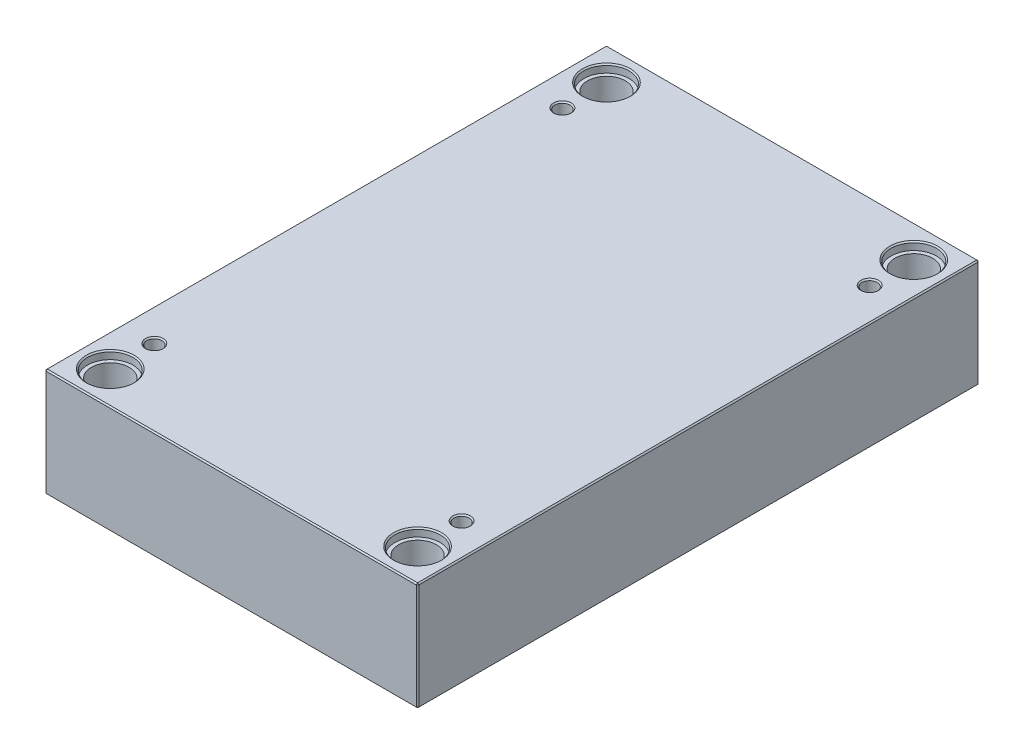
ISO-10303-21;
HEADER;
FILE_DESCRIPTION(('STEP AP214'),'2;1');
FILE_NAME('part.step','',(''),(''),'','','');
FILE_SCHEMA(('AUTOMOTIVE_DESIGN { 1 0 10303 214 1 1 1 1 }'));
ENDSEC;
DATA;
#1=APPLICATION_CONTEXT('core data for automotive mechanical design processes');
#2=APPLICATION_PROTOCOL_DEFINITION('international standard','automotive_design',2000,#1);
#3=PRODUCT_CONTEXT('',#1,'mechanical');
#4=PRODUCT('Part','Part','',(#3));
#5=PRODUCT_RELATED_PRODUCT_CATEGORY('part','',(#4));
#6=PRODUCT_DEFINITION_FORMATION('','',#4);
#7=PRODUCT_DEFINITION_CONTEXT('part definition',#1,'design');
#8=PRODUCT_DEFINITION('design','',#6,#7);
#9=PRODUCT_DEFINITION_SHAPE('','',#8);
#10=(LENGTH_UNIT() NAMED_UNIT(*) SI_UNIT(.MILLI.,.METRE.));
#11=(NAMED_UNIT(*) PLANE_ANGLE_UNIT() SI_UNIT($,.RADIAN.));
#12=(NAMED_UNIT(*) SI_UNIT($,.STERADIAN.) SOLID_ANGLE_UNIT());
#13=UNCERTAINTY_MEASURE_WITH_UNIT(LENGTH_MEASURE(1.E-05),#10,'distance_accuracy_value','');
#14=(GEOMETRIC_REPRESENTATION_CONTEXT(3) GLOBAL_UNCERTAINTY_ASSIGNED_CONTEXT((#13)) GLOBAL_UNIT_ASSIGNED_CONTEXT((#10,
#11,#12)) REPRESENTATION_CONTEXT('',''));
#15=CARTESIAN_POINT('',(0.,0.,0.));
#16=DIRECTION('',(0.,0.,1.));
#17=DIRECTION('',(1.,0.,0.));
#18=AXIS2_PLACEMENT_3D('',#15,#16,#17);
#19=CARTESIAN_POINT('',(-122.,0.,-197.));
#20=DIRECTION('',(0.,1.,0.));
#21=DIRECTION('',(0.,0.,1.));
#22=AXIS2_PLACEMENT_3D('',#19,#20,#21);
#23=CYLINDRICAL_SURFACE('',#22,15.);
#24=CARTESIAN_POINT('',(-122.,1.00000000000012,-197.));
#25=DIRECTION('',(0.,1.,0.));
#26=DIRECTION('',(0.,0.,1.));
#27=AXIS2_PLACEMENT_3D('',#24,#25,#26);
#28=CIRCLE('',#27,15.);
#29=CARTESIAN_POINT('',(-122.,1.00000000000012,-182.));
#30=VERTEX_POINT('',#29);
#31=EDGE_CURVE('E472',#30,#30,#28,.F.);
#32=ORIENTED_EDGE('',*,*,#31,.T.);
#33=EDGE_LOOP('',(#32));
#34=FACE_BOUND('',#33,.T.);
#35=CARTESIAN_POINT('',(-122.,79.7,-197.));
#36=DIRECTION('',(0.,1.,0.));
#37=DIRECTION('',(0.,0.,1.));
#38=AXIS2_PLACEMENT_3D('',#35,#36,#37);
#39=CIRCLE('',#38,15.);
#40=CARTESIAN_POINT('',(-122.,79.7,-182.));
#41=VERTEX_POINT('',#40);
#42=EDGE_CURVE('E221',#41,#41,#39,.F.);
#43=ORIENTED_EDGE('',*,*,#42,.F.);
#44=EDGE_LOOP('',(#43));
#45=FACE_BOUND('',#44,.T.);
#46=ADVANCED_FACE('F16',(#34,#45),#23,.F.);
#47=CARTESIAN_POINT('',(122.,0.,-197.));
#48=DIRECTION('',(0.,1.,0.));
#49=DIRECTION('',(0.,0.,1.));
#50=AXIS2_PLACEMENT_3D('',#47,#48,#49);
#51=CYLINDRICAL_SURFACE('',#50,15.);
#52=CARTESIAN_POINT('',(122.,0.999999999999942,-197.));
#53=DIRECTION('',(0.,1.,0.));
#54=DIRECTION('',(0.,0.,1.));
#55=AXIS2_PLACEMENT_3D('',#52,#53,#54);
#56=CIRCLE('',#55,15.);
#57=CARTESIAN_POINT('',(122.,0.999999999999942,-182.));
#58=VERTEX_POINT('',#57);
#59=EDGE_CURVE('E474',#58,#58,#56,.F.);
#60=ORIENTED_EDGE('',*,*,#59,.T.);
#61=EDGE_LOOP('',(#60));
#62=FACE_BOUND('',#61,.T.);
#63=CARTESIAN_POINT('',(122.,79.7,-197.));
#64=DIRECTION('',(0.,1.,0.));
#65=DIRECTION('',(0.,0.,1.));
#66=AXIS2_PLACEMENT_3D('',#63,#64,#65);
#67=CIRCLE('',#66,15.);
#68=CARTESIAN_POINT('',(122.,79.7,-182.));
#69=VERTEX_POINT('',#68);
#70=EDGE_CURVE('E218',#69,#69,#67,.F.);
#71=ORIENTED_EDGE('',*,*,#70,.F.);
#72=EDGE_LOOP('',(#71));
#73=FACE_BOUND('',#72,.T.);
#74=ADVANCED_FACE('F263',(#62,#73),#51,.F.);
#75=CARTESIAN_POINT('',(122.,0.,197.));
#76=DIRECTION('',(0.,1.,0.));
#77=DIRECTION('',(0.,0.,1.));
#78=AXIS2_PLACEMENT_3D('',#75,#76,#77);
#79=CYLINDRICAL_SURFACE('',#78,15.);
#80=CARTESIAN_POINT('',(122.,0.999999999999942,197.));
#81=DIRECTION('',(0.,1.,0.));
#82=DIRECTION('',(0.,0.,1.));
#83=AXIS2_PLACEMENT_3D('',#80,#81,#82);
#84=CIRCLE('',#83,15.);
#85=CARTESIAN_POINT('',(122.,0.999999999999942,212.));
#86=VERTEX_POINT('',#85);
#87=EDGE_CURVE('E477',#86,#86,#84,.F.);
#88=ORIENTED_EDGE('',*,*,#87,.T.);
#89=EDGE_LOOP('',(#88));
#90=FACE_BOUND('',#89,.T.);
#91=CARTESIAN_POINT('',(122.,79.7,197.));
#92=DIRECTION('',(0.,1.,0.));
#93=DIRECTION('',(0.,0.,1.));
#94=AXIS2_PLACEMENT_3D('',#91,#92,#93);
#95=CIRCLE('',#94,15.);
#96=CARTESIAN_POINT('',(122.,79.7,212.));
#97=VERTEX_POINT('',#96);
#98=EDGE_CURVE('E214',#97,#97,#95,.F.);
#99=ORIENTED_EDGE('',*,*,#98,.F.);
#100=EDGE_LOOP('',(#99));
#101=FACE_BOUND('',#100,.T.);
#102=ADVANCED_FACE('F270',(#90,#101),#79,.F.);
#103=CARTESIAN_POINT('',(-122.,0.,197.));
#104=DIRECTION('',(0.,1.,0.));
#105=DIRECTION('',(0.,0.,1.));
#106=AXIS2_PLACEMENT_3D('',#103,#104,#105);
#107=CYLINDRICAL_SURFACE('',#106,15.);
#108=CARTESIAN_POINT('',(-122.,1.00000000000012,197.));
#109=DIRECTION('',(0.,1.,0.));
#110=DIRECTION('',(0.,0.,1.));
#111=AXIS2_PLACEMENT_3D('',#108,#109,#110);
#112=CIRCLE('',#111,15.);
#113=CARTESIAN_POINT('',(-122.,1.00000000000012,212.));
#114=VERTEX_POINT('',#113);
#115=EDGE_CURVE('E480',#114,#114,#112,.F.);
#116=ORIENTED_EDGE('',*,*,#115,.T.);
#117=EDGE_LOOP('',(#116));
#118=FACE_BOUND('',#117,.T.);
#119=CARTESIAN_POINT('',(-122.,79.7,197.));
#120=DIRECTION('',(0.,1.,0.));
#121=DIRECTION('',(0.,0.,1.));
#122=AXIS2_PLACEMENT_3D('',#119,#120,#121);
#123=CIRCLE('',#122,15.);
#124=CARTESIAN_POINT('',(-122.,79.7,212.));
#125=VERTEX_POINT('',#124);
#126=EDGE_CURVE('E211',#125,#125,#123,.F.);
#127=ORIENTED_EDGE('',*,*,#126,.F.);
#128=EDGE_LOOP('',(#127));
#129=FACE_BOUND('',#128,.T.);
#130=ADVANCED_FACE('F277',(#118,#129),#107,.F.);
#131=CARTESIAN_POINT('',(-148.,86.,223.));
#132=DIRECTION('',(1.,0.,0.));
#133=DIRECTION('',(0.,0.,-1.));
#134=AXIS2_PLACEMENT_3D('',#131,#132,#133);
#135=PLANE('',#134);
#136=DIRECTION('',(0.,-1.,0.));
#137=VECTOR('',#136,1.);
#138=CARTESIAN_POINT('',(-148.,86.,-222.));
#139=LINE('',#138,#137);
#140=CARTESIAN_POINT('',(-148.,85.,-222.));
#141=VERTEX_POINT('',#140);
#142=CARTESIAN_POINT('',(-148.,1.,-222.));
#143=VERTEX_POINT('',#142);
#144=EDGE_CURVE('E487',#141,#143,#139,.T.);
#145=ORIENTED_EDGE('',*,*,#144,.T.);
#146=DIRECTION('',(0.,0.,1.));
#147=VECTOR('',#146,1.);
#148=CARTESIAN_POINT('',(-148.,1.,223.));
#149=LINE('',#148,#147);
#150=CARTESIAN_POINT('',(-148.,1.,222.));
#151=VERTEX_POINT('',#150);
#152=EDGE_CURVE('E490',#143,#151,#149,.T.);
#153=ORIENTED_EDGE('',*,*,#152,.T.);
#154=DIRECTION('',(0.,1.,0.));
#155=VECTOR('',#154,1.);
#156=CARTESIAN_POINT('',(-148.,86.,222.));
#157=LINE('',#156,#155);
#158=CARTESIAN_POINT('',(-148.,85.,222.));
#159=VERTEX_POINT('',#158);
#160=EDGE_CURVE('E485',#151,#159,#157,.T.);
#161=ORIENTED_EDGE('',*,*,#160,.T.);
#162=DIRECTION('',(0.,0.,-1.));
#163=VECTOR('',#162,1.);
#164=CARTESIAN_POINT('',(-148.,85.,-223.));
#165=LINE('',#164,#163);
#166=EDGE_CURVE('E483',#159,#141,#165,.T.);
#167=ORIENTED_EDGE('',*,*,#166,.T.);
#168=EDGE_LOOP('',(#145,#153,#161,#167));
#169=FACE_BOUND('',#168,.T.);
#170=ADVANCED_FACE('F298',(#169),#135,.F.);
#171=CARTESIAN_POINT('',(148.,86.,223.));
#172=DIRECTION('',(0.,0.,-1.));
#173=DIRECTION('',(-1.,0.,0.));
#174=AXIS2_PLACEMENT_3D('',#171,#172,#173);
#175=PLANE('',#174);
#176=DIRECTION('',(-1.,0.,0.));
#177=VECTOR('',#176,1.);
#178=CARTESIAN_POINT('',(-148.,85.,223.));
#179=LINE('',#178,#177);
#180=CARTESIAN_POINT('',(147.,85.,223.));
#181=VERTEX_POINT('',#180);
#182=CARTESIAN_POINT('',(-147.,85.,223.));
#183=VERTEX_POINT('',#182);
#184=EDGE_CURVE('E509',#181,#183,#179,.T.);
#185=ORIENTED_EDGE('',*,*,#184,.T.);
#186=DIRECTION('',(0.,-1.,0.));
#187=VECTOR('',#186,1.);
#188=CARTESIAN_POINT('',(-147.,86.,223.));
#189=LINE('',#188,#187);
#190=CARTESIAN_POINT('',(-147.,1.,223.));
#191=VERTEX_POINT('',#190);
#192=EDGE_CURVE('E515',#183,#191,#189,.T.);
#193=ORIENTED_EDGE('',*,*,#192,.T.);
#194=DIRECTION('',(1.,0.,0.));
#195=VECTOR('',#194,1.);
#196=CARTESIAN_POINT('',(148.,1.,223.));
#197=LINE('',#196,#195);
#198=CARTESIAN_POINT('',(147.,1.,223.));
#199=VERTEX_POINT('',#198);
#200=EDGE_CURVE('E513',#191,#199,#197,.T.);
#201=ORIENTED_EDGE('',*,*,#200,.T.);
#202=DIRECTION('',(0.,1.,0.));
#203=VECTOR('',#202,1.);
#204=CARTESIAN_POINT('',(147.,86.,223.));
#205=LINE('',#204,#203);
#206=EDGE_CURVE('E511',#199,#181,#205,.T.);
#207=ORIENTED_EDGE('',*,*,#206,.T.);
#208=EDGE_LOOP('',(#185,#193,#201,#207));
#209=FACE_BOUND('',#208,.T.);
#210=ADVANCED_FACE('F294',(#209),#175,.F.);
#211=CARTESIAN_POINT('',(148.,86.,223.));
#212=DIRECTION('',(-1.,0.,0.));
#213=DIRECTION('',(0.,0.,1.));
#214=AXIS2_PLACEMENT_3D('',#211,#212,#213);
#215=PLANE('',#214);
#216=DIRECTION('',(0.,0.,-1.));
#217=VECTOR('',#216,1.);
#218=CARTESIAN_POINT('',(148.,1.,223.));
#219=LINE('',#218,#217);
#220=CARTESIAN_POINT('',(148.,1.,222.));
#221=VERTEX_POINT('',#220);
#222=CARTESIAN_POINT('',(148.,1.,-222.));
#223=VERTEX_POINT('',#222);
#224=EDGE_CURVE('E504',#221,#223,#219,.T.);
#225=ORIENTED_EDGE('',*,*,#224,.T.);
#226=DIRECTION('',(0.,1.,0.));
#227=VECTOR('',#226,1.);
#228=CARTESIAN_POINT('',(148.,86.,-222.));
#229=LINE('',#228,#227);
#230=CARTESIAN_POINT('',(148.,85.,-222.));
#231=VERTEX_POINT('',#230);
#232=EDGE_CURVE('E506',#223,#231,#229,.T.);
#233=ORIENTED_EDGE('',*,*,#232,.T.);
#234=DIRECTION('',(0.,0.,1.));
#235=VECTOR('',#234,1.);
#236=CARTESIAN_POINT('',(148.,85.,223.));
#237=LINE('',#236,#235);
#238=CARTESIAN_POINT('',(148.,85.,222.));
#239=VERTEX_POINT('',#238);
#240=EDGE_CURVE('E500',#231,#239,#237,.T.);
#241=ORIENTED_EDGE('',*,*,#240,.T.);
#242=DIRECTION('',(0.,-1.,0.));
#243=VECTOR('',#242,1.);
#244=CARTESIAN_POINT('',(148.,86.,222.));
#245=LINE('',#244,#243);
#246=EDGE_CURVE('E502',#239,#221,#245,.T.);
#247=ORIENTED_EDGE('',*,*,#246,.T.);
#248=EDGE_LOOP('',(#225,#233,#241,#247));
#249=FACE_BOUND('',#248,.T.);
#250=ADVANCED_FACE('F290',(#249),#215,.F.);
#251=CARTESIAN_POINT('',(148.,86.,-223.));
#252=DIRECTION('',(0.,0.,1.));
#253=DIRECTION('',(1.,0.,0.));
#254=AXIS2_PLACEMENT_3D('',#251,#252,#253);
#255=PLANE('',#254);
#256=DIRECTION('',(0.,-1.,0.));
#257=VECTOR('',#256,1.);
#258=CARTESIAN_POINT('',(147.,86.,-223.));
#259=LINE('',#258,#257);
#260=CARTESIAN_POINT('',(147.,85.,-223.));
#261=VERTEX_POINT('',#260);
#262=CARTESIAN_POINT('',(147.,1.,-223.));
#263=VERTEX_POINT('',#262);
#264=EDGE_CURVE('E494',#261,#263,#259,.T.);
#265=ORIENTED_EDGE('',*,*,#264,.T.);
#266=DIRECTION('',(-1.,0.,0.));
#267=VECTOR('',#266,1.);
#268=CARTESIAN_POINT('',(148.,1.,-223.));
#269=LINE('',#268,#267);
#270=CARTESIAN_POINT('',(-147.,1.,-223.));
#271=VERTEX_POINT('',#270);
#272=EDGE_CURVE('E138',#263,#271,#269,.T.);
#273=ORIENTED_EDGE('',*,*,#272,.T.);
#274=DIRECTION('',(0.,1.,0.));
#275=VECTOR('',#274,1.);
#276=CARTESIAN_POINT('',(-147.,86.,-223.));
#277=LINE('',#276,#275);
#278=CARTESIAN_POINT('',(-147.,85.,-223.));
#279=VERTEX_POINT('',#278);
#280=EDGE_CURVE('E496',#271,#279,#277,.T.);
#281=ORIENTED_EDGE('',*,*,#280,.T.);
#282=DIRECTION('',(1.,0.,0.));
#283=VECTOR('',#282,1.);
#284=CARTESIAN_POINT('',(148.,85.,-223.));
#285=LINE('',#284,#283);
#286=EDGE_CURVE('E492',#279,#261,#285,.T.);
#287=ORIENTED_EDGE('',*,*,#286,.T.);
#288=EDGE_LOOP('',(#265,#273,#281,#287));
#289=FACE_BOUND('',#288,.T.);
#290=ADVANCED_FACE('F282',(#289),#255,.F.);
#291=CARTESIAN_POINT('',(0.,86.,0.));
#292=DIRECTION('',(0.,1.,0.));
#293=DIRECTION('',(0.,0.,1.));
#294=AXIS2_PLACEMENT_3D('',#291,#292,#293);
#295=PLANE('',#294);
#296=CARTESIAN_POINT('',(122.,86.,197.));
#297=DIRECTION('',(0.,1.,0.));
#298=DIRECTION('',(0.,0.,1.));
#299=AXIS2_PLACEMENT_3D('',#296,#297,#298);
#300=CIRCLE('',#299,19.);
#301=CARTESIAN_POINT('',(122.,86.,216.));
#302=VERTEX_POINT('',#301);
#303=EDGE_CURVE('E236',#302,#302,#300,.F.);
#304=ORIENTED_EDGE('',*,*,#303,.T.);
#305=EDGE_LOOP('',(#304));
#306=FACE_BOUND('',#305,.T.);
#307=CARTESIAN_POINT('',(-122.,86.,197.));
#308=DIRECTION('',(0.,1.,0.));
#309=DIRECTION('',(0.,0.,1.));
#310=AXIS2_PLACEMENT_3D('',#307,#308,#309);
#311=CIRCLE('',#310,19.);
#312=CARTESIAN_POINT('',(-122.,86.,216.));
#313=VERTEX_POINT('',#312);
#314=EDGE_CURVE('E233',#313,#313,#311,.F.);
#315=ORIENTED_EDGE('',*,*,#314,.T.);
#316=EDGE_LOOP('',(#315));
#317=FACE_BOUND('',#316,.T.);
#318=CARTESIAN_POINT('',(122.,86.,-197.));
#319=DIRECTION('',(0.,1.,0.));
#320=DIRECTION('',(0.,0.,1.));
#321=AXIS2_PLACEMENT_3D('',#318,#319,#320);
#322=CIRCLE('',#321,19.);
#323=CARTESIAN_POINT('',(122.,86.,-178.));
#324=VERTEX_POINT('',#323);
#325=EDGE_CURVE('E230',#324,#324,#322,.F.);
#326=ORIENTED_EDGE('',*,*,#325,.T.);
#327=EDGE_LOOP('',(#326));
#328=FACE_BOUND('',#327,.T.);
#329=CARTESIAN_POINT('',(-122.,86.,-197.));
#330=DIRECTION('',(0.,1.,0.));
#331=DIRECTION('',(0.,0.,1.));
#332=AXIS2_PLACEMENT_3D('',#329,#330,#331);
#333=CIRCLE('',#332,19.);
#334=CARTESIAN_POINT('',(-122.,86.,-178.));
#335=VERTEX_POINT('',#334);
#336=EDGE_CURVE('E227',#335,#335,#333,.F.);
#337=ORIENTED_EDGE('',*,*,#336,.T.);
#338=EDGE_LOOP('',(#337));
#339=FACE_BOUND('',#338,.T.);
#340=CARTESIAN_POINT('',(-122.,86.,162.));
#341=DIRECTION('',(0.,1.,0.));
#342=DIRECTION('',(0.,0.,1.));
#343=AXIS2_PLACEMENT_3D('',#340,#341,#342);
#344=CIRCLE('',#343,7.);
#345=CARTESIAN_POINT('',(-122.,86.,169.));
#346=VERTEX_POINT('',#345);
#347=EDGE_CURVE('E198',#346,#346,#344,.F.);
#348=ORIENTED_EDGE('',*,*,#347,.T.);
#349=EDGE_LOOP('',(#348));
#350=FACE_BOUND('',#349,.T.);
#351=CARTESIAN_POINT('',(122.,86.,162.));
#352=DIRECTION('',(0.,1.,0.));
#353=DIRECTION('',(0.,0.,1.));
#354=AXIS2_PLACEMENT_3D('',#351,#352,#353);
#355=CIRCLE('',#354,7.);
#356=CARTESIAN_POINT('',(122.,86.,169.));
#357=VERTEX_POINT('',#356);
#358=EDGE_CURVE('E195',#357,#357,#355,.F.);
#359=ORIENTED_EDGE('',*,*,#358,.T.);
#360=EDGE_LOOP('',(#359));
#361=FACE_BOUND('',#360,.T.);
#362=CARTESIAN_POINT('',(122.,86.,-162.));
#363=DIRECTION('',(0.,1.,0.));
#364=DIRECTION('',(0.,0.,1.));
#365=AXIS2_PLACEMENT_3D('',#362,#363,#364);
#366=CIRCLE('',#365,7.00000000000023);
#367=CARTESIAN_POINT('',(122.,86.,-155.));
#368=VERTEX_POINT('',#367);
#369=EDGE_CURVE('E192',#368,#368,#366,.F.);
#370=ORIENTED_EDGE('',*,*,#369,.T.);
#371=EDGE_LOOP('',(#370));
#372=FACE_BOUND('',#371,.T.);
#373=CARTESIAN_POINT('',(-122.,86.,-162.));
#374=DIRECTION('',(0.,1.,0.));
#375=DIRECTION('',(0.,0.,1.));
#376=AXIS2_PLACEMENT_3D('',#373,#374,#375);
#377=CIRCLE('',#376,7.);
#378=CARTESIAN_POINT('',(-122.,86.,-155.));
#379=VERTEX_POINT('',#378);
#380=EDGE_CURVE('E188',#379,#379,#377,.F.);
#381=ORIENTED_EDGE('',*,*,#380,.T.);
#382=EDGE_LOOP('',(#381));
#383=FACE_BOUND('',#382,.T.);
#384=DIRECTION('',(0.,0.,-1.));
#385=VECTOR('',#384,1.);
#386=CARTESIAN_POINT('',(147.,86.,-223.));
#387=LINE('',#386,#385);
#388=CARTESIAN_POINT('',(147.,86.,222.));
#389=VERTEX_POINT('',#388);
#390=CARTESIAN_POINT('',(147.,86.,-222.));
#391=VERTEX_POINT('',#390);
#392=EDGE_CURVE('E31',#389,#391,#387,.T.);
#393=ORIENTED_EDGE('',*,*,#392,.T.);
#394=DIRECTION('',(-1.,0.,0.));
#395=VECTOR('',#394,1.);
#396=CARTESIAN_POINT('',(-148.,86.,-222.));
#397=LINE('',#396,#395);
#398=CARTESIAN_POINT('',(-147.,86.,-222.));
#399=VERTEX_POINT('',#398);
#400=EDGE_CURVE('E189',#391,#399,#397,.T.);
#401=ORIENTED_EDGE('',*,*,#400,.T.);
#402=DIRECTION('',(0.,0.,1.));
#403=VECTOR('',#402,1.);
#404=CARTESIAN_POINT('',(-147.,86.,223.));
#405=LINE('',#404,#403);
#406=CARTESIAN_POINT('',(-147.,86.,222.));
#407=VERTEX_POINT('',#406);
#408=EDGE_CURVE('E518',#399,#407,#405,.T.);
#409=ORIENTED_EDGE('',*,*,#408,.T.);
#410=DIRECTION('',(1.,0.,0.));
#411=VECTOR('',#410,1.);
#412=CARTESIAN_POINT('',(148.,86.,222.));
#413=LINE('',#412,#411);
#414=EDGE_CURVE('E36',#407,#389,#413,.T.);
#415=ORIENTED_EDGE('',*,*,#414,.T.);
#416=EDGE_LOOP('',(#393,#401,#409,#415));
#417=FACE_BOUND('',#416,.T.);
#418=ADVANCED_FACE('F279',(#306,#317,#328,#339,#350,#361,#372,#383,#417),#295,.T.);
#419=CARTESIAN_POINT('',(0.,0.,0.));
#420=DIRECTION('',(0.,1.,0.));
#421=DIRECTION('',(0.,0.,1.));
#422=AXIS2_PLACEMENT_3D('',#419,#420,#421);
#423=PLANE('',#422);
#424=CARTESIAN_POINT('',(-122.,0.,-197.));
#425=DIRECTION('',(0.,1.,0.));
#426=DIRECTION('',(0.,0.,1.));
#427=AXIS2_PLACEMENT_3D('',#424,#425,#426);
#428=CIRCLE('',#427,16.);
#429=CARTESIAN_POINT('',(-122.,0.,-181.));
#430=VERTEX_POINT('',#429);
#431=EDGE_CURVE('E469',#430,#430,#428,.T.);
#432=ORIENTED_EDGE('',*,*,#431,.T.);
#433=EDGE_LOOP('',(#432));
#434=FACE_BOUND('',#433,.T.);
#435=CARTESIAN_POINT('',(122.,0.,-197.));
#436=DIRECTION('',(0.,1.,0.));
#437=DIRECTION('',(0.,0.,1.));
#438=AXIS2_PLACEMENT_3D('',#435,#436,#437);
#439=CIRCLE('',#438,16.);
#440=CARTESIAN_POINT('',(122.,0.,-181.));
#441=VERTEX_POINT('',#440);
#442=EDGE_CURVE('E466',#441,#441,#439,.T.);
#443=ORIENTED_EDGE('',*,*,#442,.T.);
#444=EDGE_LOOP('',(#443));
#445=FACE_BOUND('',#444,.T.);
#446=CARTESIAN_POINT('',(122.,0.,197.));
#447=DIRECTION('',(0.,1.,0.));
#448=DIRECTION('',(0.,0.,1.));
#449=AXIS2_PLACEMENT_3D('',#446,#447,#448);
#450=CIRCLE('',#449,16.);
#451=CARTESIAN_POINT('',(122.,0.,213.));
#452=VERTEX_POINT('',#451);
#453=EDGE_CURVE('E463',#452,#452,#450,.T.);
#454=ORIENTED_EDGE('',*,*,#453,.T.);
#455=EDGE_LOOP('',(#454));
#456=FACE_BOUND('',#455,.T.);
#457=CARTESIAN_POINT('',(-122.,0.,197.));
#458=DIRECTION('',(0.,1.,0.));
#459=DIRECTION('',(0.,0.,1.));
#460=AXIS2_PLACEMENT_3D('',#457,#458,#459);
#461=CIRCLE('',#460,16.);
#462=CARTESIAN_POINT('',(-122.,0.,213.));
#463=VERTEX_POINT('',#462);
#464=EDGE_CURVE('E460',#463,#463,#461,.T.);
#465=ORIENTED_EDGE('',*,*,#464,.T.);
#466=EDGE_LOOP('',(#465));
#467=FACE_BOUND('',#466,.T.);
#468=DIRECTION('',(0.,0.,1.));
#469=VECTOR('',#468,1.);
#470=CARTESIAN_POINT('',(147.,0.,0.));
#471=LINE('',#470,#469);
#472=CARTESIAN_POINT('',(147.,0.,-222.));
#473=VERTEX_POINT('',#472);
#474=CARTESIAN_POINT('',(147.,0.,222.));
#475=VERTEX_POINT('',#474);
#476=EDGE_CURVE('E108',#473,#475,#471,.T.);
#477=ORIENTED_EDGE('',*,*,#476,.T.);
#478=DIRECTION('',(-1.,0.,0.));
#479=VECTOR('',#478,1.);
#480=CARTESIAN_POINT('',(0.,0.,222.));
#481=LINE('',#480,#479);
#482=CARTESIAN_POINT('',(-147.,0.,222.));
#483=VERTEX_POINT('',#482);
#484=EDGE_CURVE('E458',#475,#483,#481,.T.);
#485=ORIENTED_EDGE('',*,*,#484,.T.);
#486=DIRECTION('',(0.,0.,-1.));
#487=VECTOR('',#486,1.);
#488=CARTESIAN_POINT('',(-147.,0.,0.));
#489=LINE('',#488,#487);
#490=CARTESIAN_POINT('',(-147.,0.,-222.));
#491=VERTEX_POINT('',#490);
#492=EDGE_CURVE('E110',#483,#491,#489,.T.);
#493=ORIENTED_EDGE('',*,*,#492,.T.);
#494=DIRECTION('',(1.,0.,0.));
#495=VECTOR('',#494,1.);
#496=CARTESIAN_POINT('',(0.,0.,-222.));
#497=LINE('',#496,#495);
#498=EDGE_CURVE('E104',#491,#473,#497,.T.);
#499=ORIENTED_EDGE('',*,*,#498,.T.);
#500=EDGE_LOOP('',(#477,#485,#493,#499));
#501=FACE_BOUND('',#500,.T.);
#502=ADVANCED_FACE('F106',(#434,#445,#456,#467,#501),#423,.F.);
#503=CARTESIAN_POINT('',(-122.,0.,-197.));
#504=DIRECTION('',(0.,-1.,0.));
#505=DIRECTION('',(0.,0.,-1.));
#506=AXIS2_PLACEMENT_3D('',#503,#504,#505);
#507=CONICAL_SURFACE('',#506,16.,0.78539816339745);
#508=ORIENTED_EDGE('',*,*,#31,.F.);
#509=EDGE_LOOP('',(#508));
#510=FACE_BOUND('',#509,.T.);
#511=ORIENTED_EDGE('',*,*,#431,.F.);
#512=EDGE_LOOP('',(#511));
#513=FACE_BOUND('',#512,.T.);
#514=ADVANCED_FACE('F286',(#510,#513),#507,.F.);
#515=CARTESIAN_POINT('',(122.,0.,-197.));
#516=DIRECTION('',(0.,-1.,0.));
#517=DIRECTION('',(0.,0.,-1.));
#518=AXIS2_PLACEMENT_3D('',#515,#516,#517);
#519=CONICAL_SURFACE('',#518,16.,0.78539816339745);
#520=ORIENTED_EDGE('',*,*,#59,.F.);
#521=EDGE_LOOP('',(#520));
#522=FACE_BOUND('',#521,.T.);
#523=ORIENTED_EDGE('',*,*,#442,.F.);
#524=EDGE_LOOP('',(#523));
#525=FACE_BOUND('',#524,.T.);
#526=ADVANCED_FACE('F305',(#522,#525),#519,.F.);
#527=CARTESIAN_POINT('',(122.,0.,197.));
#528=DIRECTION('',(0.,-1.,0.));
#529=DIRECTION('',(0.,0.,-1.));
#530=AXIS2_PLACEMENT_3D('',#527,#528,#529);
#531=CONICAL_SURFACE('',#530,16.,0.78539816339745);
#532=ORIENTED_EDGE('',*,*,#87,.F.);
#533=EDGE_LOOP('',(#532));
#534=FACE_BOUND('',#533,.T.);
#535=ORIENTED_EDGE('',*,*,#453,.F.);
#536=EDGE_LOOP('',(#535));
#537=FACE_BOUND('',#536,.T.);
#538=ADVANCED_FACE('F309',(#534,#537),#531,.F.);
#539=CARTESIAN_POINT('',(-122.,0.,197.));
#540=DIRECTION('',(0.,-1.,0.));
#541=DIRECTION('',(0.,0.,-1.));
#542=AXIS2_PLACEMENT_3D('',#539,#540,#541);
#543=CONICAL_SURFACE('',#542,16.,0.78539816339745);
#544=ORIENTED_EDGE('',*,*,#115,.F.);
#545=EDGE_LOOP('',(#544));
#546=FACE_BOUND('',#545,.T.);
#547=ORIENTED_EDGE('',*,*,#464,.F.);
#548=EDGE_LOOP('',(#547));
#549=FACE_BOUND('',#548,.T.);
#550=ADVANCED_FACE('F313',(#546,#549),#543,.F.);
#551=CARTESIAN_POINT('',(148.,86.,222.));
#552=DIRECTION('',(-0.707106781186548,0.,-0.707106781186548));
#553=DIRECTION('',(0.,-1.,0.));
#554=AXIS2_PLACEMENT_3D('',#551,#552,#553);
#555=PLANE('',#554);
#556=DIRECTION('',(-0.707106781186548,0.,0.707106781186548));
#557=VECTOR('',#556,1.);
#558=CARTESIAN_POINT('',(147.,85.,223.));
#559=LINE('',#558,#557);
#560=EDGE_CURVE('E126',#181,#239,#559,.F.);
#561=ORIENTED_EDGE('',*,*,#560,.F.);
#562=ORIENTED_EDGE('',*,*,#206,.F.);
#563=DIRECTION('',(0.707106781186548,0.,-0.707106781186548));
#564=VECTOR('',#563,1.);
#565=CARTESIAN_POINT('',(147.,1.,223.));
#566=LINE('',#565,#564);
#567=EDGE_CURVE('E180',#221,#199,#566,.F.);
#568=ORIENTED_EDGE('',*,*,#567,.F.);
#569=ORIENTED_EDGE('',*,*,#246,.F.);
#570=EDGE_LOOP('',(#561,#562,#568,#569));
#571=FACE_BOUND('',#570,.T.);
#572=ADVANCED_FACE('F317',(#571),#555,.F.);
#573=CARTESIAN_POINT('',(147.,85.,223.));
#574=DIRECTION('',(0.577350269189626,0.577350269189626,0.577350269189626));
#575=DIRECTION('',(0.707106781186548,0.,-0.707106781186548));
#576=AXIS2_PLACEMENT_3D('',#573,#574,#575);
#577=PLANE('',#576);
#578=DIRECTION('',(0.,-0.707106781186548,0.707106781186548));
#579=VECTOR('',#578,1.);
#580=CARTESIAN_POINT('',(147.,85.,223.));
#581=LINE('',#580,#579);
#582=EDGE_CURVE('E175',#181,#389,#581,.F.);
#583=ORIENTED_EDGE('',*,*,#582,.F.);
#584=ORIENTED_EDGE('',*,*,#560,.T.);
#585=DIRECTION('',(-0.707106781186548,0.707106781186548,0.));
#586=VECTOR('',#585,1.);
#587=CARTESIAN_POINT('',(147.5,85.5,222.));
#588=LINE('',#587,#586);
#589=EDGE_CURVE('E177',#389,#239,#588,.F.);
#590=ORIENTED_EDGE('',*,*,#589,.F.);
#591=EDGE_LOOP('',(#583,#584,#590));
#592=FACE_BOUND('',#591,.T.);
#593=ADVANCED_FACE('F385',(#592),#577,.T.);
#594=CARTESIAN_POINT('',(147.,1.,223.));
#595=DIRECTION('',(0.577350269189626,-0.577350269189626,0.577350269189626));
#596=DIRECTION('',(0.707106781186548,0.,-0.707106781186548));
#597=AXIS2_PLACEMENT_3D('',#594,#595,#596);
#598=PLANE('',#597);
#599=DIRECTION('',(-0.707106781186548,-0.707106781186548,0.));
#600=VECTOR('',#599,1.);
#601=CARTESIAN_POINT('',(147.5,0.5,222.));
#602=LINE('',#601,#600);
#603=EDGE_CURVE('E124',#221,#475,#602,.T.);
#604=ORIENTED_EDGE('',*,*,#603,.F.);
#605=ORIENTED_EDGE('',*,*,#567,.T.);
#606=DIRECTION('',(0.,0.707106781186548,0.707106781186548));
#607=VECTOR('',#606,1.);
#608=CARTESIAN_POINT('',(147.,1.,223.));
#609=LINE('',#608,#607);
#610=EDGE_CURVE('E172',#475,#199,#609,.T.);
#611=ORIENTED_EDGE('',*,*,#610,.F.);
#612=EDGE_LOOP('',(#604,#605,#611));
#613=FACE_BOUND('',#612,.T.);
#614=ADVANCED_FACE('F381',(#613),#598,.T.);
#615=CARTESIAN_POINT('',(147.,86.,0.));
#616=DIRECTION('',(0.707106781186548,0.707106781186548,0.));
#617=DIRECTION('',(0.,0.,1.));
#618=AXIS2_PLACEMENT_3D('',#615,#616,#617);
#619=PLANE('',#618);
#620=ORIENTED_EDGE('',*,*,#589,.T.);
#621=ORIENTED_EDGE('',*,*,#240,.F.);
#622=DIRECTION('',(0.707106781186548,-0.707106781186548,0.));
#623=VECTOR('',#622,1.);
#624=CARTESIAN_POINT('',(148.,85.,-222.));
#625=LINE('',#624,#623);
#626=EDGE_CURVE('E166',#391,#231,#625,.T.);
#627=ORIENTED_EDGE('',*,*,#626,.F.);
#628=ORIENTED_EDGE('',*,*,#392,.F.);
#629=EDGE_LOOP('',(#620,#621,#627,#628));
#630=FACE_BOUND('',#629,.T.);
#631=ADVANCED_FACE('F377',(#630),#619,.T.);
#632=CARTESIAN_POINT('',(0.,86.,222.));
#633=DIRECTION('',(0.,0.707106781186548,0.707106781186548));
#634=DIRECTION('',(-1.,0.,0.));
#635=AXIS2_PLACEMENT_3D('',#632,#633,#634);
#636=PLANE('',#635);
#637=ORIENTED_EDGE('',*,*,#582,.T.);
#638=ORIENTED_EDGE('',*,*,#414,.F.);
#639=DIRECTION('',(0.,0.707106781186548,-0.707106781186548));
#640=VECTOR('',#639,1.);
#641=CARTESIAN_POINT('',(-147.,85.5,222.5));
#642=LINE('',#641,#640);
#643=EDGE_CURVE('E163',#183,#407,#642,.T.);
#644=ORIENTED_EDGE('',*,*,#643,.F.);
#645=ORIENTED_EDGE('',*,*,#184,.F.);
#646=EDGE_LOOP('',(#637,#638,#644,#645));
#647=FACE_BOUND('',#646,.T.);
#648=ADVANCED_FACE('F373',(#647),#636,.T.);
#649=CARTESIAN_POINT('',(-147.,86.,223.));
#650=DIRECTION('',(0.707106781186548,0.,-0.707106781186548));
#651=DIRECTION('',(0.,-1.,0.));
#652=AXIS2_PLACEMENT_3D('',#649,#650,#651);
#653=PLANE('',#652);
#654=DIRECTION('',(0.707106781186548,0.,0.707106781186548));
#655=VECTOR('',#654,1.);
#656=CARTESIAN_POINT('',(-147.,1.,223.));
#657=LINE('',#656,#655);
#658=EDGE_CURVE('E157',#191,#151,#657,.F.);
#659=ORIENTED_EDGE('',*,*,#658,.F.);
#660=ORIENTED_EDGE('',*,*,#192,.F.);
#661=DIRECTION('',(-0.707106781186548,0.,-0.707106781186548));
#662=VECTOR('',#661,1.);
#663=CARTESIAN_POINT('',(-148.,85.,222.));
#664=LINE('',#663,#662);
#665=EDGE_CURVE('E160',#159,#183,#664,.F.);
#666=ORIENTED_EDGE('',*,*,#665,.F.);
#667=ORIENTED_EDGE('',*,*,#160,.F.);
#668=EDGE_LOOP('',(#659,#660,#666,#667));
#669=FACE_BOUND('',#668,.T.);
#670=ADVANCED_FACE('F369',(#669),#653,.F.);
#671=CARTESIAN_POINT('',(148.,1.,223.));
#672=DIRECTION('',(0.,0.707106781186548,-0.707106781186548));
#673=DIRECTION('',(1.,0.,0.));
#674=AXIS2_PLACEMENT_3D('',#671,#672,#673);
#675=PLANE('',#674);
#676=ORIENTED_EDGE('',*,*,#610,.T.);
#677=ORIENTED_EDGE('',*,*,#200,.F.);
#678=DIRECTION('',(0.,-0.707106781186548,-0.707106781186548));
#679=VECTOR('',#678,1.);
#680=CARTESIAN_POINT('',(-147.,1.,223.));
#681=LINE('',#680,#679);
#682=EDGE_CURVE('E135',#483,#191,#681,.F.);
#683=ORIENTED_EDGE('',*,*,#682,.F.);
#684=ORIENTED_EDGE('',*,*,#484,.F.);
#685=EDGE_LOOP('',(#676,#677,#683,#684));
#686=FACE_BOUND('',#685,.T.);
#687=ADVANCED_FACE('F366',(#686),#675,.F.);
#688=CARTESIAN_POINT('',(148.,1.,223.));
#689=DIRECTION('',(-0.707106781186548,0.707106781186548,0.));
#690=DIRECTION('',(0.,0.,-1.));
#691=AXIS2_PLACEMENT_3D('',#688,#689,#690);
#692=PLANE('',#691);
#693=ORIENTED_EDGE('',*,*,#603,.T.);
#694=ORIENTED_EDGE('',*,*,#476,.F.);
#695=DIRECTION('',(0.707106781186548,0.707106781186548,0.));
#696=VECTOR('',#695,1.);
#697=CARTESIAN_POINT('',(147.5,0.5,-222.));
#698=LINE('',#697,#696);
#699=EDGE_CURVE('E121',#223,#473,#698,.F.);
#700=ORIENTED_EDGE('',*,*,#699,.F.);
#701=ORIENTED_EDGE('',*,*,#224,.F.);
#702=EDGE_LOOP('',(#693,#694,#700,#701));
#703=FACE_BOUND('',#702,.T.);
#704=ADVANCED_FACE('F119',(#703),#692,.F.);
#705=CARTESIAN_POINT('',(147.,86.,-223.));
#706=DIRECTION('',(-0.707106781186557,0.,0.707106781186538));
#707=DIRECTION('',(0.,-1.,0.));
#708=AXIS2_PLACEMENT_3D('',#705,#706,#707);
#709=PLANE('',#708);
#710=DIRECTION('',(0.707106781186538,0.,0.707106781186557));
#711=VECTOR('',#710,1.);
#712=CARTESIAN_POINT('',(148.,85.,-222.));
#713=LINE('',#712,#711);
#714=EDGE_CURVE('E168',#231,#261,#713,.F.);
#715=ORIENTED_EDGE('',*,*,#714,.F.);
#716=ORIENTED_EDGE('',*,*,#232,.F.);
#717=DIRECTION('',(-0.707106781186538,0.,-0.707106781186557));
#718=VECTOR('',#717,1.);
#719=CARTESIAN_POINT('',(147.,1.,-223.));
#720=LINE('',#719,#718);
#721=EDGE_CURVE('E134',#263,#223,#720,.F.);
#722=ORIENTED_EDGE('',*,*,#721,.F.);
#723=ORIENTED_EDGE('',*,*,#264,.F.);
#724=EDGE_LOOP('',(#715,#716,#722,#723));
#725=FACE_BOUND('',#724,.T.);
#726=ADVANCED_FACE('F359',(#725),#709,.F.);
#727=CARTESIAN_POINT('',(148.,85.,-222.));
#728=DIRECTION('',(0.577350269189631,0.577350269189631,-0.577350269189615));
#729=DIRECTION('',(-0.707106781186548,0.707106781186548,0.));
#730=AXIS2_PLACEMENT_3D('',#727,#728,#729);
#731=PLANE('',#730);
#732=ORIENTED_EDGE('',*,*,#626,.T.);
#733=ORIENTED_EDGE('',*,*,#714,.T.);
#734=DIRECTION('',(0.,0.707106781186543,0.707106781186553));
#735=VECTOR('',#734,1.);
#736=CARTESIAN_POINT('',(147.,85.5,-222.5));
#737=LINE('',#736,#735);
#738=EDGE_CURVE('E152',#391,#261,#737,.F.);
#739=ORIENTED_EDGE('',*,*,#738,.F.);
#740=EDGE_LOOP('',(#732,#733,#739));
#741=FACE_BOUND('',#740,.T.);
#742=ADVANCED_FACE('F355',(#741),#731,.T.);
#743=CARTESIAN_POINT('',(-148.,85.,222.));
#744=DIRECTION('',(-0.577350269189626,0.577350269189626,0.577350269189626));
#745=DIRECTION('',(0.707106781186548,0.,0.707106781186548));
#746=AXIS2_PLACEMENT_3D('',#743,#744,#745);
#747=PLANE('',#746);
#748=ORIENTED_EDGE('',*,*,#665,.T.);
#749=ORIENTED_EDGE('',*,*,#643,.T.);
#750=DIRECTION('',(-0.707106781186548,-0.707106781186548,0.));
#751=VECTOR('',#750,1.);
#752=CARTESIAN_POINT('',(-148.,85.,222.));
#753=LINE('',#752,#751);
#754=EDGE_CURVE('E143',#159,#407,#753,.F.);
#755=ORIENTED_EDGE('',*,*,#754,.F.);
#756=EDGE_LOOP('',(#748,#749,#755));
#757=FACE_BOUND('',#756,.T.);
#758=ADVANCED_FACE('F351',(#757),#747,.T.);
#759=CARTESIAN_POINT('',(-147.,1.,223.));
#760=DIRECTION('',(-0.577350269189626,-0.577350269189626,0.577350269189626));
#761=DIRECTION('',(0.707106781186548,0.,0.707106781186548));
#762=AXIS2_PLACEMENT_3D('',#759,#760,#761);
#763=PLANE('',#762);
#764=ORIENTED_EDGE('',*,*,#682,.T.);
#765=ORIENTED_EDGE('',*,*,#658,.T.);
#766=DIRECTION('',(-0.707106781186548,0.707106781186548,0.));
#767=VECTOR('',#766,1.);
#768=CARTESIAN_POINT('',(-147.5,0.5,222.));
#769=LINE('',#768,#767);
#770=EDGE_CURVE('E139',#483,#151,#769,.T.);
#771=ORIENTED_EDGE('',*,*,#770,.F.);
#772=EDGE_LOOP('',(#764,#765,#771));
#773=FACE_BOUND('',#772,.T.);
#774=ADVANCED_FACE('F348',(#773),#763,.T.);
#775=CARTESIAN_POINT('',(147.,1.,-223.));
#776=DIRECTION('',(0.577350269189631,-0.577350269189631,-0.577350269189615));
#777=DIRECTION('',(0.707106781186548,0.707106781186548,0.));
#778=AXIS2_PLACEMENT_3D('',#775,#776,#777);
#779=PLANE('',#778);
#780=ORIENTED_EDGE('',*,*,#721,.T.);
#781=ORIENTED_EDGE('',*,*,#699,.T.);
#782=DIRECTION('',(0.,-0.707106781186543,0.707106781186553));
#783=VECTOR('',#782,1.);
#784=CARTESIAN_POINT('',(147.,1.,-223.));
#785=LINE('',#784,#783);
#786=EDGE_CURVE('E131',#263,#473,#785,.T.);
#787=ORIENTED_EDGE('',*,*,#786,.F.);
#788=EDGE_LOOP('',(#780,#781,#787));
#789=FACE_BOUND('',#788,.T.);
#790=ADVANCED_FACE('F130',(#789),#779,.T.);
#791=CARTESIAN_POINT('',(0.,86.,-222.));
#792=DIRECTION('',(0.,0.707106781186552,-0.707106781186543));
#793=DIRECTION('',(1.,0.,0.));
#794=AXIS2_PLACEMENT_3D('',#791,#792,#793);
#795=PLANE('',#794);
#796=ORIENTED_EDGE('',*,*,#738,.T.);
#797=ORIENTED_EDGE('',*,*,#286,.F.);
#798=DIRECTION('',(0.,-0.707106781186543,-0.707106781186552));
#799=VECTOR('',#798,1.);
#800=CARTESIAN_POINT('',(-147.,85.,-223.));
#801=LINE('',#800,#799);
#802=EDGE_CURVE('E140',#399,#279,#801,.T.);
#803=ORIENTED_EDGE('',*,*,#802,.F.);
#804=ORIENTED_EDGE('',*,*,#400,.F.);
#805=EDGE_LOOP('',(#796,#797,#803,#804));
#806=FACE_BOUND('',#805,.T.);
#807=ADVANCED_FACE('F341',(#806),#795,.T.);
#808=CARTESIAN_POINT('',(-147.,86.,0.));
#809=DIRECTION('',(-0.707106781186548,0.707106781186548,0.));
#810=DIRECTION('',(0.,0.,-1.));
#811=AXIS2_PLACEMENT_3D('',#808,#809,#810);
#812=PLANE('',#811);
#813=ORIENTED_EDGE('',*,*,#754,.T.);
#814=ORIENTED_EDGE('',*,*,#408,.F.);
#815=DIRECTION('',(0.707106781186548,0.707106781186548,0.));
#816=VECTOR('',#815,1.);
#817=CARTESIAN_POINT('',(-147.5,85.5,-222.));
#818=LINE('',#817,#816);
#819=EDGE_CURVE('E146',#141,#399,#818,.T.);
#820=ORIENTED_EDGE('',*,*,#819,.F.);
#821=ORIENTED_EDGE('',*,*,#166,.F.);
#822=EDGE_LOOP('',(#813,#814,#820,#821));
#823=FACE_BOUND('',#822,.T.);
#824=ADVANCED_FACE('F337',(#823),#812,.T.);
#825=CARTESIAN_POINT('',(-148.,1.,223.));
#826=DIRECTION('',(0.707106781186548,0.707106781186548,0.));
#827=DIRECTION('',(0.,0.,1.));
#828=AXIS2_PLACEMENT_3D('',#825,#826,#827);
#829=PLANE('',#828);
#830=ORIENTED_EDGE('',*,*,#770,.T.);
#831=ORIENTED_EDGE('',*,*,#152,.F.);
#832=DIRECTION('',(0.707106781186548,-0.707106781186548,0.));
#833=VECTOR('',#832,1.);
#834=CARTESIAN_POINT('',(-148.,1.,-222.));
#835=LINE('',#834,#833);
#836=EDGE_CURVE('E529',#491,#143,#835,.F.);
#837=ORIENTED_EDGE('',*,*,#836,.F.);
#838=ORIENTED_EDGE('',*,*,#492,.F.);
#839=EDGE_LOOP('',(#830,#831,#837,#838));
#840=FACE_BOUND('',#839,.T.);
#841=ADVANCED_FACE('F334',(#840),#829,.F.);
#842=CARTESIAN_POINT('',(148.,1.,-223.));
#843=DIRECTION('',(0.,0.707106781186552,0.707106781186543));
#844=DIRECTION('',(-1.,0.,0.));
#845=AXIS2_PLACEMENT_3D('',#842,#843,#844);
#846=PLANE('',#845);
#847=ORIENTED_EDGE('',*,*,#786,.T.);
#848=ORIENTED_EDGE('',*,*,#498,.F.);
#849=DIRECTION('',(0.,0.707106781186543,-0.707106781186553));
#850=VECTOR('',#849,1.);
#851=CARTESIAN_POINT('',(-147.,0.500000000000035,-222.5));
#852=LINE('',#851,#850);
#853=EDGE_CURVE('E526',#271,#491,#852,.F.);
#854=ORIENTED_EDGE('',*,*,#853,.F.);
#855=ORIENTED_EDGE('',*,*,#272,.F.);
#856=EDGE_LOOP('',(#847,#848,#854,#855));
#857=FACE_BOUND('',#856,.T.);
#858=ADVANCED_FACE('F137',(#857),#846,.F.);
#859=CARTESIAN_POINT('',(-147.,85.,-223.));
#860=DIRECTION('',(-0.577350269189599,0.577350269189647,-0.577350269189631));
#861=DIRECTION('',(0.,0.707106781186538,0.707106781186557));
#862=AXIS2_PLACEMENT_3D('',#859,#860,#861);
#863=PLANE('',#862);
#864=ORIENTED_EDGE('',*,*,#819,.T.);
#865=ORIENTED_EDGE('',*,*,#802,.T.);
#866=DIRECTION('',(0.707106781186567,0.,-0.707106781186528));
#867=VECTOR('',#866,1.);
#868=CARTESIAN_POINT('',(-147.,85.,-223.));
#869=LINE('',#868,#867);
#870=EDGE_CURVE('E524',#141,#279,#869,.T.);
#871=ORIENTED_EDGE('',*,*,#870,.F.);
#872=EDGE_LOOP('',(#864,#865,#871));
#873=FACE_BOUND('',#872,.T.);
#874=ADVANCED_FACE('F327',(#873),#863,.T.);
#875=CARTESIAN_POINT('',(-148.,1.,-222.));
#876=DIRECTION('',(-0.577350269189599,-0.577350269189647,-0.577350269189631));
#877=DIRECTION('',(0.,0.707106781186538,-0.707106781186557));
#878=AXIS2_PLACEMENT_3D('',#875,#876,#877);
#879=PLANE('',#878);
#880=ORIENTED_EDGE('',*,*,#853,.T.);
#881=ORIENTED_EDGE('',*,*,#836,.T.);
#882=DIRECTION('',(-0.707106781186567,0.,0.707106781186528));
#883=VECTOR('',#882,1.);
#884=CARTESIAN_POINT('',(-148.,1.,-222.));
#885=LINE('',#884,#883);
#886=EDGE_CURVE('E455',#271,#143,#885,.T.);
#887=ORIENTED_EDGE('',*,*,#886,.F.);
#888=EDGE_LOOP('',(#880,#881,#887));
#889=FACE_BOUND('',#888,.T.);
#890=ADVANCED_FACE('F323',(#889),#879,.T.);
#891=CARTESIAN_POINT('',(-148.,86.,-222.));
#892=DIRECTION('',(0.707106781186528,0.,0.707106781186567));
#893=DIRECTION('',(0.,-1.,0.));
#894=AXIS2_PLACEMENT_3D('',#891,#892,#893);
#895=PLANE('',#894);
#896=ORIENTED_EDGE('',*,*,#870,.T.);
#897=ORIENTED_EDGE('',*,*,#280,.F.);
#898=ORIENTED_EDGE('',*,*,#886,.T.);
#899=ORIENTED_EDGE('',*,*,#144,.F.);
#900=EDGE_LOOP('',(#896,#897,#898,#899));
#901=FACE_BOUND('',#900,.T.);
#902=ADVANCED_FACE('F319',(#901),#895,.F.);
#903=CARTESIAN_POINT('',(-122.,62.,-162.));
#904=DIRECTION('',(0.,1.,0.));
#905=DIRECTION('',(0.,0.,1.));
#906=AXIS2_PLACEMENT_3D('',#903,#904,#905);
#907=CYLINDRICAL_SURFACE('',#906,6.);
#908=CARTESIAN_POINT('',(-122.,85.,-162.));
#909=DIRECTION('',(0.,1.,0.));
#910=DIRECTION('',(0.,0.,1.));
#911=AXIS2_PLACEMENT_3D('',#908,#909,#910);
#912=CIRCLE('',#911,6.);
#913=CARTESIAN_POINT('',(-122.,85.,-156.));
#914=VERTEX_POINT('',#913);
#915=EDGE_CURVE('E207',#914,#914,#912,.T.);
#916=ORIENTED_EDGE('',*,*,#915,.T.);
#917=EDGE_LOOP('',(#916));
#918=FACE_BOUND('',#917,.T.);
#919=CARTESIAN_POINT('',(-122.,62.,-162.));
#920=DIRECTION('',(0.,1.,0.));
#921=DIRECTION('',(0.,0.,1.));
#922=AXIS2_PLACEMENT_3D('',#919,#920,#921);
#923=CIRCLE('',#922,6.);
#924=CARTESIAN_POINT('',(-122.,62.,-156.));
#925=VERTEX_POINT('',#924);
#926=EDGE_CURVE('E448',#925,#925,#923,.T.);
#927=ORIENTED_EDGE('',*,*,#926,.F.);
#928=EDGE_LOOP('',(#927));
#929=FACE_BOUND('',#928,.T.);
#930=ADVANCED_FACE('F322',(#918,#929),#907,.F.);
#931=CARTESIAN_POINT('',(-122.,62.,-162.));
#932=DIRECTION('',(0.,1.,0.));
#933=DIRECTION('',(0.,0.,1.));
#934=AXIS2_PLACEMENT_3D('',#931,#932,#933);
#935=PLANE('',#934);
#936=ORIENTED_EDGE('',*,*,#926,.T.);
#937=EDGE_LOOP('',(#936));
#938=FACE_BOUND('',#937,.T.);
#939=ADVANCED_FACE('F596',(#938),#935,.T.);
#940=CARTESIAN_POINT('',(122.,62.,-162.));
#941=DIRECTION('',(0.,1.,0.));
#942=DIRECTION('',(0.,0.,1.));
#943=AXIS2_PLACEMENT_3D('',#940,#941,#942);
#944=CYLINDRICAL_SURFACE('',#943,6.);
#945=CARTESIAN_POINT('',(122.,85.,-162.));
#946=DIRECTION('',(0.,1.,0.));
#947=DIRECTION('',(0.,0.,1.));
#948=AXIS2_PLACEMENT_3D('',#945,#946,#947);
#949=CIRCLE('',#948,6.);
#950=CARTESIAN_POINT('',(122.,85.,-156.));
#951=VERTEX_POINT('',#950);
#952=EDGE_CURVE('E204',#951,#951,#949,.T.);
#953=ORIENTED_EDGE('',*,*,#952,.T.);
#954=EDGE_LOOP('',(#953));
#955=FACE_BOUND('',#954,.T.);
#956=CARTESIAN_POINT('',(122.,62.,-162.));
#957=DIRECTION('',(0.,1.,0.));
#958=DIRECTION('',(0.,0.,1.));
#959=AXIS2_PLACEMENT_3D('',#956,#957,#958);
#960=CIRCLE('',#959,6.);
#961=CARTESIAN_POINT('',(122.,62.,-156.));
#962=VERTEX_POINT('',#961);
#963=EDGE_CURVE('E445',#962,#962,#960,.T.);
#964=ORIENTED_EDGE('',*,*,#963,.F.);
#965=EDGE_LOOP('',(#964));
#966=FACE_BOUND('',#965,.T.);
#967=ADVANCED_FACE('F592',(#955,#966),#944,.F.);
#968=CARTESIAN_POINT('',(122.,62.,-162.));
#969=DIRECTION('',(0.,1.,0.));
#970=DIRECTION('',(0.,0.,1.));
#971=AXIS2_PLACEMENT_3D('',#968,#969,#970);
#972=PLANE('',#971);
#973=ORIENTED_EDGE('',*,*,#963,.T.);
#974=EDGE_LOOP('',(#973));
#975=FACE_BOUND('',#974,.T.);
#976=ADVANCED_FACE('F588',(#975),#972,.T.);
#977=CARTESIAN_POINT('',(122.,62.,162.));
#978=DIRECTION('',(0.,1.,0.));
#979=DIRECTION('',(0.,0.,1.));
#980=AXIS2_PLACEMENT_3D('',#977,#978,#979);
#981=CYLINDRICAL_SURFACE('',#980,6.);
#982=CARTESIAN_POINT('',(122.,85.,162.));
#983=DIRECTION('',(0.,1.,0.));
#984=DIRECTION('',(0.,0.,1.));
#985=AXIS2_PLACEMENT_3D('',#982,#983,#984);
#986=CIRCLE('',#985,6.);
#987=CARTESIAN_POINT('',(122.,85.,168.));
#988=VERTEX_POINT('',#987);
#989=EDGE_CURVE('E201',#988,#988,#986,.T.);
#990=ORIENTED_EDGE('',*,*,#989,.T.);
#991=EDGE_LOOP('',(#990));
#992=FACE_BOUND('',#991,.T.);
#993=CARTESIAN_POINT('',(122.,62.,162.));
#994=DIRECTION('',(0.,1.,0.));
#995=DIRECTION('',(0.,0.,1.));
#996=AXIS2_PLACEMENT_3D('',#993,#994,#995);
#997=CIRCLE('',#996,6.);
#998=CARTESIAN_POINT('',(122.,62.,168.));
#999=VERTEX_POINT('',#998);
#1000=EDGE_CURVE('E449',#999,#999,#997,.T.);
#1001=ORIENTED_EDGE('',*,*,#1000,.F.);
#1002=EDGE_LOOP('',(#1001));
#1003=FACE_BOUND('',#1002,.T.);
#1004=ADVANCED_FACE('F591',(#992,#1003),#981,.F.);
#1005=CARTESIAN_POINT('',(122.,62.,162.));
#1006=DIRECTION('',(0.,1.,0.));
#1007=DIRECTION('',(0.,0.,1.));
#1008=AXIS2_PLACEMENT_3D('',#1005,#1006,#1007);
#1009=PLANE('',#1008);
#1010=ORIENTED_EDGE('',*,*,#1000,.T.);
#1011=EDGE_LOOP('',(#1010));
#1012=FACE_BOUND('',#1011,.T.);
#1013=ADVANCED_FACE('F598',(#1012),#1009,.T.);
#1014=CARTESIAN_POINT('',(-122.,62.,162.));
#1015=DIRECTION('',(0.,1.,0.));
#1016=DIRECTION('',(0.,0.,1.));
#1017=AXIS2_PLACEMENT_3D('',#1014,#1015,#1016);
#1018=CYLINDRICAL_SURFACE('',#1017,6.);
#1019=CARTESIAN_POINT('',(-122.,85.,162.));
#1020=DIRECTION('',(0.,1.,0.));
#1021=DIRECTION('',(0.,0.,1.));
#1022=AXIS2_PLACEMENT_3D('',#1019,#1020,#1021);
#1023=CIRCLE('',#1022,6.);
#1024=CARTESIAN_POINT('',(-122.,85.,168.));
#1025=VERTEX_POINT('',#1024);
#1026=EDGE_CURVE('E185',#1025,#1025,#1023,.T.);
#1027=ORIENTED_EDGE('',*,*,#1026,.T.);
#1028=EDGE_LOOP('',(#1027));
#1029=FACE_BOUND('',#1028,.T.);
#1030=CARTESIAN_POINT('',(-122.,62.,162.));
#1031=DIRECTION('',(0.,1.,0.));
#1032=DIRECTION('',(0.,0.,1.));
#1033=AXIS2_PLACEMENT_3D('',#1030,#1031,#1032);
#1034=CIRCLE('',#1033,6.);
#1035=CARTESIAN_POINT('',(-122.,62.,168.));
#1036=VERTEX_POINT('',#1035);
#1037=EDGE_CURVE('E224',#1036,#1036,#1034,.T.);
#1038=ORIENTED_EDGE('',*,*,#1037,.F.);
#1039=EDGE_LOOP('',(#1038));
#1040=FACE_BOUND('',#1039,.T.);
#1041=ADVANCED_FACE('F601',(#1029,#1040),#1018,.F.);
#1042=CARTESIAN_POINT('',(-122.,62.,162.));
#1043=DIRECTION('',(0.,1.,0.));
#1044=DIRECTION('',(0.,0.,1.));
#1045=AXIS2_PLACEMENT_3D('',#1042,#1043,#1044);
#1046=PLANE('',#1045);
#1047=ORIENTED_EDGE('',*,*,#1037,.T.);
#1048=EDGE_LOOP('',(#1047));
#1049=FACE_BOUND('',#1048,.T.);
#1050=ADVANCED_FACE('F397',(#1049),#1046,.T.);
#1051=CARTESIAN_POINT('',(-122.,85.,162.));
#1052=DIRECTION('',(0.,1.,0.));
#1053=DIRECTION('',(0.,0.,1.));
#1054=AXIS2_PLACEMENT_3D('',#1051,#1052,#1053);
#1055=CONICAL_SURFACE('',#1054,6.,0.785398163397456);
#1056=ORIENTED_EDGE('',*,*,#347,.F.);
#1057=EDGE_LOOP('',(#1056));
#1058=FACE_BOUND('',#1057,.T.);
#1059=ORIENTED_EDGE('',*,*,#1026,.F.);
#1060=EDGE_LOOP('',(#1059));
#1061=FACE_BOUND('',#1060,.T.);
#1062=ADVANCED_FACE('F393',(#1058,#1061),#1055,.F.);
#1063=CARTESIAN_POINT('',(122.,85.,162.));
#1064=DIRECTION('',(0.,1.,0.));
#1065=DIRECTION('',(0.,0.,1.));
#1066=AXIS2_PLACEMENT_3D('',#1063,#1064,#1065);
#1067=CONICAL_SURFACE('',#1066,6.,0.785398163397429);
#1068=ORIENTED_EDGE('',*,*,#358,.F.);
#1069=EDGE_LOOP('',(#1068));
#1070=FACE_BOUND('',#1069,.T.);
#1071=ORIENTED_EDGE('',*,*,#989,.F.);
#1072=EDGE_LOOP('',(#1071));
#1073=FACE_BOUND('',#1072,.T.);
#1074=ADVANCED_FACE('F396',(#1070,#1073),#1067,.F.);
#1075=CARTESIAN_POINT('',(122.,85.,-162.));
#1076=DIRECTION('',(0.,1.,0.));
#1077=DIRECTION('',(0.,0.,1.));
#1078=AXIS2_PLACEMENT_3D('',#1075,#1076,#1077);
#1079=CONICAL_SURFACE('',#1078,6.,0.785398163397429);
#1080=ORIENTED_EDGE('',*,*,#369,.F.);
#1081=EDGE_LOOP('',(#1080));
#1082=FACE_BOUND('',#1081,.T.);
#1083=ORIENTED_EDGE('',*,*,#952,.F.);
#1084=EDGE_LOOP('',(#1083));
#1085=FACE_BOUND('',#1084,.T.);
#1086=ADVANCED_FACE('F401',(#1082,#1085),#1079,.F.);
#1087=CARTESIAN_POINT('',(-122.,85.,-162.));
#1088=DIRECTION('',(0.,1.,0.));
#1089=DIRECTION('',(0.,0.,1.));
#1090=AXIS2_PLACEMENT_3D('',#1087,#1088,#1089);
#1091=CONICAL_SURFACE('',#1090,6.,0.785398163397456);
#1092=ORIENTED_EDGE('',*,*,#380,.F.);
#1093=EDGE_LOOP('',(#1092));
#1094=FACE_BOUND('',#1093,.T.);
#1095=ORIENTED_EDGE('',*,*,#915,.F.);
#1096=EDGE_LOOP('',(#1095));
#1097=FACE_BOUND('',#1096,.T.);
#1098=ADVANCED_FACE('F405',(#1094,#1097),#1091,.F.);
#1099=CARTESIAN_POINT('',(-122.,79.7,197.));
#1100=DIRECTION('',(0.,1.,0.));
#1101=DIRECTION('',(0.,0.,1.));
#1102=AXIS2_PLACEMENT_3D('',#1099,#1100,#1101);
#1103=PLANE('',#1102);
#1104=CARTESIAN_POINT('',(-122.,79.7,197.));
#1105=DIRECTION('',(0.,1.,0.));
#1106=DIRECTION('',(0.,0.,1.));
#1107=AXIS2_PLACEMENT_3D('',#1104,#1105,#1106);
#1108=CIRCLE('',#1107,18.);
#1109=CARTESIAN_POINT('',(-122.,79.7,215.));
#1110=VERTEX_POINT('',#1109);
#1111=EDGE_CURVE('E436',#1110,#1110,#1108,.T.);
#1112=ORIENTED_EDGE('',*,*,#1111,.T.);
#1113=EDGE_LOOP('',(#1112));
#1114=FACE_BOUND('',#1113,.T.);
#1115=ORIENTED_EDGE('',*,*,#126,.T.);
#1116=EDGE_LOOP('',(#1115));
#1117=FACE_BOUND('',#1116,.T.);
#1118=ADVANCED_FACE('F409',(#1114,#1117),#1103,.T.);
#1119=CARTESIAN_POINT('',(-122.,79.7,197.));
#1120=DIRECTION('',(0.,1.,0.));
#1121=DIRECTION('',(0.,0.,1.));
#1122=AXIS2_PLACEMENT_3D('',#1119,#1120,#1121);
#1123=CYLINDRICAL_SURFACE('',#1122,18.);
#1124=CARTESIAN_POINT('',(-122.,85.,197.));
#1125=DIRECTION('',(0.,1.,0.));
#1126=DIRECTION('',(0.,0.,1.));
#1127=AXIS2_PLACEMENT_3D('',#1124,#1125,#1126);
#1128=CIRCLE('',#1127,18.);
#1129=CARTESIAN_POINT('',(-122.,85.,215.));
#1130=VERTEX_POINT('',#1129);
#1131=EDGE_CURVE('E239',#1130,#1130,#1128,.T.);
#1132=ORIENTED_EDGE('',*,*,#1131,.T.);
#1133=EDGE_LOOP('',(#1132));
#1134=FACE_BOUND('',#1133,.T.);
#1135=ORIENTED_EDGE('',*,*,#1111,.F.);
#1136=EDGE_LOOP('',(#1135));
#1137=FACE_BOUND('',#1136,.T.);
#1138=ADVANCED_FACE('F574',(#1134,#1137),#1123,.F.);
#1139=CARTESIAN_POINT('',(122.,79.7,197.));
#1140=DIRECTION('',(0.,1.,0.));
#1141=DIRECTION('',(0.,0.,1.));
#1142=AXIS2_PLACEMENT_3D('',#1139,#1140,#1141);
#1143=PLANE('',#1142);
#1144=CARTESIAN_POINT('',(122.,79.7,197.));
#1145=DIRECTION('',(0.,1.,0.));
#1146=DIRECTION('',(0.,0.,1.));
#1147=AXIS2_PLACEMENT_3D('',#1144,#1145,#1146);
#1148=CIRCLE('',#1147,18.);
#1149=CARTESIAN_POINT('',(122.,79.7,215.));
#1150=VERTEX_POINT('',#1149);
#1151=EDGE_CURVE('E433',#1150,#1150,#1148,.T.);
#1152=ORIENTED_EDGE('',*,*,#1151,.T.);
#1153=EDGE_LOOP('',(#1152));
#1154=FACE_BOUND('',#1153,.T.);
#1155=ORIENTED_EDGE('',*,*,#98,.T.);
#1156=EDGE_LOOP('',(#1155));
#1157=FACE_BOUND('',#1156,.T.);
#1158=ADVANCED_FACE('F429',(#1154,#1157),#1143,.T.);
#1159=CARTESIAN_POINT('',(122.,79.7,197.));
#1160=DIRECTION('',(0.,1.,0.));
#1161=DIRECTION('',(0.,0.,1.));
#1162=AXIS2_PLACEMENT_3D('',#1159,#1160,#1161);
#1163=CYLINDRICAL_SURFACE('',#1162,18.);
#1164=CARTESIAN_POINT('',(122.,85.,197.));
#1165=DIRECTION('',(0.,1.,0.));
#1166=DIRECTION('',(0.,0.,1.));
#1167=AXIS2_PLACEMENT_3D('',#1164,#1165,#1166);
#1168=CIRCLE('',#1167,18.);
#1169=CARTESIAN_POINT('',(122.,85.,215.));
#1170=VERTEX_POINT('',#1169);
#1171=EDGE_CURVE('E210',#1170,#1170,#1168,.T.);
#1172=ORIENTED_EDGE('',*,*,#1171,.T.);
#1173=EDGE_LOOP('',(#1172));
#1174=FACE_BOUND('',#1173,.T.);
#1175=ORIENTED_EDGE('',*,*,#1151,.F.);
#1176=EDGE_LOOP('',(#1175));
#1177=FACE_BOUND('',#1176,.T.);
#1178=ADVANCED_FACE('F425',(#1174,#1177),#1163,.F.);
#1179=CARTESIAN_POINT('',(122.,79.7,-197.));
#1180=DIRECTION('',(0.,1.,0.));
#1181=DIRECTION('',(0.,0.,1.));
#1182=AXIS2_PLACEMENT_3D('',#1179,#1180,#1181);
#1183=PLANE('',#1182);
#1184=CARTESIAN_POINT('',(122.,79.7,-197.));
#1185=DIRECTION('',(0.,1.,0.));
#1186=DIRECTION('',(0.,0.,1.));
#1187=AXIS2_PLACEMENT_3D('',#1184,#1185,#1186);
#1188=CIRCLE('',#1187,18.);
#1189=CARTESIAN_POINT('',(122.,79.7,-179.));
#1190=VERTEX_POINT('',#1189);
#1191=EDGE_CURVE('E435',#1190,#1190,#1188,.T.);
#1192=ORIENTED_EDGE('',*,*,#1191,.T.);
#1193=EDGE_LOOP('',(#1192));
#1194=FACE_BOUND('',#1193,.T.);
#1195=ORIENTED_EDGE('',*,*,#70,.T.);
#1196=EDGE_LOOP('',(#1195));
#1197=FACE_BOUND('',#1196,.T.);
#1198=ADVANCED_FACE('F428',(#1194,#1197),#1183,.T.);
#1199=CARTESIAN_POINT('',(122.,79.7,-197.));
#1200=DIRECTION('',(0.,1.,0.));
#1201=DIRECTION('',(0.,0.,1.));
#1202=AXIS2_PLACEMENT_3D('',#1199,#1200,#1201);
#1203=CYLINDRICAL_SURFACE('',#1202,18.);
#1204=CARTESIAN_POINT('',(122.,85.,-197.));
#1205=DIRECTION('',(0.,1.,0.));
#1206=DIRECTION('',(0.,0.,1.));
#1207=AXIS2_PLACEMENT_3D('',#1204,#1205,#1206);
#1208=CIRCLE('',#1207,18.);
#1209=CARTESIAN_POINT('',(122.,85.,-179.));
#1210=VERTEX_POINT('',#1209);
#1211=EDGE_CURVE('E24',#1210,#1210,#1208,.T.);
#1212=ORIENTED_EDGE('',*,*,#1211,.T.);
#1213=EDGE_LOOP('',(#1212));
#1214=FACE_BOUND('',#1213,.T.);
#1215=ORIENTED_EDGE('',*,*,#1191,.F.);
#1216=EDGE_LOOP('',(#1215));
#1217=FACE_BOUND('',#1216,.T.);
#1218=ADVANCED_FACE('F244',(#1214,#1217),#1203,.F.);
#1219=CARTESIAN_POINT('',(-122.,79.7,-197.));
#1220=DIRECTION('',(0.,1.,0.));
#1221=DIRECTION('',(0.,0.,1.));
#1222=AXIS2_PLACEMENT_3D('',#1219,#1220,#1221);
#1223=PLANE('',#1222);
#1224=CARTESIAN_POINT('',(-122.,79.7,-197.));
#1225=DIRECTION('',(0.,1.,0.));
#1226=DIRECTION('',(0.,0.,1.));
#1227=AXIS2_PLACEMENT_3D('',#1224,#1225,#1226);
#1228=CIRCLE('',#1227,18.);
#1229=CARTESIAN_POINT('',(-122.,79.7,-179.));
#1230=VERTEX_POINT('',#1229);
#1231=EDGE_CURVE('E215',#1230,#1230,#1228,.T.);
#1232=ORIENTED_EDGE('',*,*,#1231,.T.);
#1233=EDGE_LOOP('',(#1232));
#1234=FACE_BOUND('',#1233,.T.);
#1235=ORIENTED_EDGE('',*,*,#42,.T.);
#1236=EDGE_LOOP('',(#1235));
#1237=FACE_BOUND('',#1236,.T.);
#1238=ADVANCED_FACE('F418',(#1234,#1237),#1223,.T.);
#1239=CARTESIAN_POINT('',(-122.,79.7,-197.));
#1240=DIRECTION('',(0.,1.,0.));
#1241=DIRECTION('',(0.,0.,1.));
#1242=AXIS2_PLACEMENT_3D('',#1239,#1240,#1241);
#1243=CYLINDRICAL_SURFACE('',#1242,18.);
#1244=CARTESIAN_POINT('',(-122.,85.,-197.));
#1245=DIRECTION('',(0.,1.,0.));
#1246=DIRECTION('',(0.,0.,1.));
#1247=AXIS2_PLACEMENT_3D('',#1244,#1245,#1246);
#1248=CIRCLE('',#1247,18.);
#1249=CARTESIAN_POINT('',(-122.,85.,-179.));
#1250=VERTEX_POINT('',#1249);
#1251=EDGE_CURVE('E10',#1250,#1250,#1248,.T.);
#1252=ORIENTED_EDGE('',*,*,#1251,.T.);
#1253=EDGE_LOOP('',(#1252));
#1254=FACE_BOUND('',#1253,.T.);
#1255=ORIENTED_EDGE('',*,*,#1231,.F.);
#1256=EDGE_LOOP('',(#1255));
#1257=FACE_BOUND('',#1256,.T.);
#1258=ADVANCED_FACE('F412',(#1254,#1257),#1243,.F.);
#1259=CARTESIAN_POINT('',(122.,85.,197.));
#1260=DIRECTION('',(0.,1.,0.));
#1261=DIRECTION('',(0.,0.,1.));
#1262=AXIS2_PLACEMENT_3D('',#1259,#1260,#1261);
#1263=CONICAL_SURFACE('',#1262,18.,0.785398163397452);
#1264=ORIENTED_EDGE('',*,*,#303,.F.);
#1265=EDGE_LOOP('',(#1264));
#1266=FACE_BOUND('',#1265,.T.);
#1267=ORIENTED_EDGE('',*,*,#1171,.F.);
#1268=EDGE_LOOP('',(#1267));
#1269=FACE_BOUND('',#1268,.T.);
#1270=ADVANCED_FACE('F258',(#1266,#1269),#1263,.F.);
#1271=CARTESIAN_POINT('',(-122.,85.,197.));
#1272=DIRECTION('',(0.,1.,0.));
#1273=DIRECTION('',(0.,0.,1.));
#1274=AXIS2_PLACEMENT_3D('',#1271,#1272,#1273);
#1275=CONICAL_SURFACE('',#1274,18.,0.785398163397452);
#1276=ORIENTED_EDGE('',*,*,#314,.F.);
#1277=EDGE_LOOP('',(#1276));
#1278=FACE_BOUND('',#1277,.T.);
#1279=ORIENTED_EDGE('',*,*,#1131,.F.);
#1280=EDGE_LOOP('',(#1279));
#1281=FACE_BOUND('',#1280,.T.);
#1282=ADVANCED_FACE('F249',(#1278,#1281),#1275,.F.);
#1283=CARTESIAN_POINT('',(122.,85.,-197.));
#1284=DIRECTION('',(0.,1.,0.));
#1285=DIRECTION('',(0.,0.,1.));
#1286=AXIS2_PLACEMENT_3D('',#1283,#1284,#1285);
#1287=CONICAL_SURFACE('',#1286,18.,0.785398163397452);
#1288=ORIENTED_EDGE('',*,*,#325,.F.);
#1289=EDGE_LOOP('',(#1288));
#1290=FACE_BOUND('',#1289,.T.);
#1291=ORIENTED_EDGE('',*,*,#1211,.F.);
#1292=EDGE_LOOP('',(#1291));
#1293=FACE_BOUND('',#1292,.T.);
#1294=ADVANCED_FACE('F247',(#1290,#1293),#1287,.F.);
#1295=CARTESIAN_POINT('',(-122.,85.,-197.));
#1296=DIRECTION('',(0.,1.,0.));
#1297=DIRECTION('',(0.,0.,1.));
#1298=AXIS2_PLACEMENT_3D('',#1295,#1296,#1297);
#1299=CONICAL_SURFACE('',#1298,18.,0.785398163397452);
#1300=ORIENTED_EDGE('',*,*,#336,.F.);
#1301=EDGE_LOOP('',(#1300));
#1302=FACE_BOUND('',#1301,.T.);
#1303=ORIENTED_EDGE('',*,*,#1251,.F.);
#1304=EDGE_LOOP('',(#1303));
#1305=FACE_BOUND('',#1304,.T.);
#1306=ADVANCED_FACE('F18',(#1302,#1305),#1299,.F.);
#1307=CLOSED_SHELL('',(#46,#74,#102,#130,#170,#210,#250,#290,#418,#502,#514,#526,#538,#550,#572,
#593,#614,#631,#648,#670,#687,#704,#726,#742,#758,#774,#790,#807,#824,#841,#858,#874,#890,#902,
#930,#939,#967,#976,#1004,#1013,#1041,#1050,#1062,#1074,#1086,#1098,#1118,#1138,#1158,#1178,
#1198,#1218,#1238,#1258,#1270,#1282,#1294,#1306));
#1308=MANIFOLD_SOLID_BREP('B1',#1307);
#1309=ADVANCED_BREP_SHAPE_REPRESENTATION('',(#18,#1308),#14);
#1310=SHAPE_DEFINITION_REPRESENTATION(#9,#1309);
ENDSEC;
END-ISO-10303-21;
